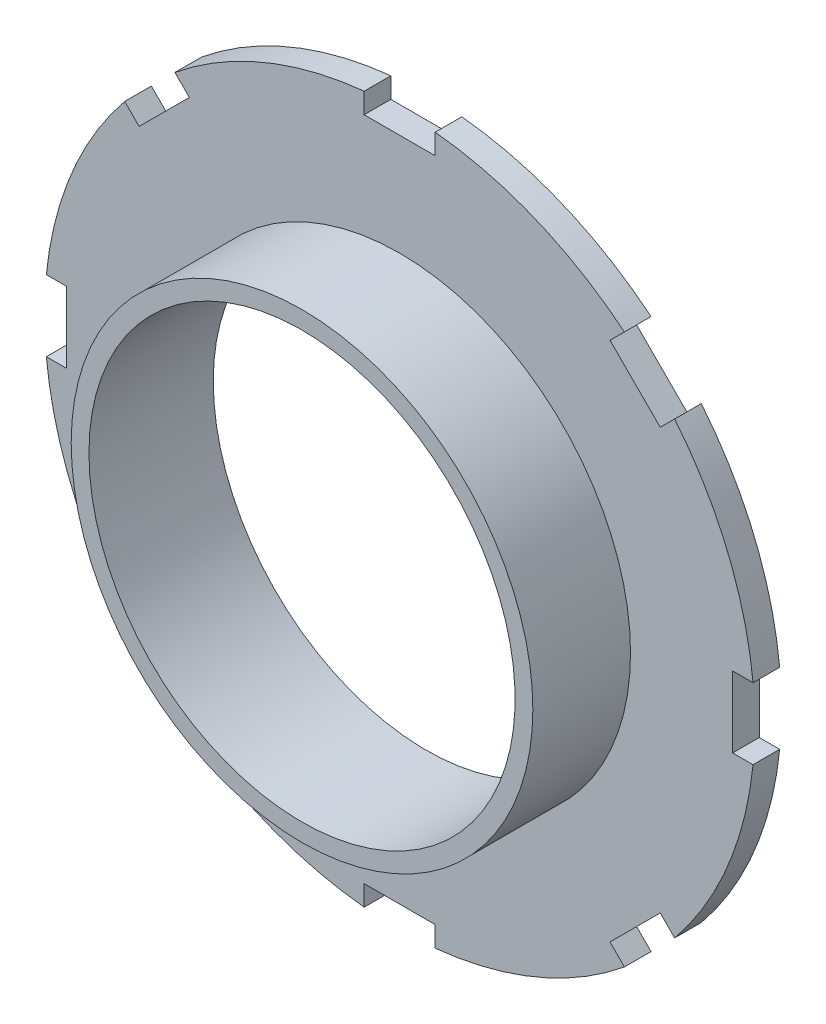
ISO-10303-21;
HEADER;
FILE_DESCRIPTION(('STEP AP214'),'2;1');
FILE_NAME('part.step','',(''),(''),'','','');
FILE_SCHEMA(('AUTOMOTIVE_DESIGN { 1 0 10303 214 1 1 1 1 }'));
ENDSEC;
DATA;
#1=APPLICATION_CONTEXT('core data for automotive mechanical design processes');
#2=APPLICATION_PROTOCOL_DEFINITION('international standard','automotive_design',2000,#1);
#3=PRODUCT_CONTEXT('',#1,'mechanical');
#4=PRODUCT('Part','Part','',(#3));
#5=PRODUCT_RELATED_PRODUCT_CATEGORY('part','',(#4));
#6=PRODUCT_DEFINITION_FORMATION('','',#4);
#7=PRODUCT_DEFINITION_CONTEXT('part definition',#1,'design');
#8=PRODUCT_DEFINITION('design','',#6,#7);
#9=PRODUCT_DEFINITION_SHAPE('','',#8);
#10=(LENGTH_UNIT() NAMED_UNIT(*) SI_UNIT(.MILLI.,.METRE.));
#11=(NAMED_UNIT(*) PLANE_ANGLE_UNIT() SI_UNIT($,.RADIAN.));
#12=(NAMED_UNIT(*) SI_UNIT($,.STERADIAN.) SOLID_ANGLE_UNIT());
#13=UNCERTAINTY_MEASURE_WITH_UNIT(LENGTH_MEASURE(1.E-05),#10,'distance_accuracy_value','');
#14=(GEOMETRIC_REPRESENTATION_CONTEXT(3) GLOBAL_UNCERTAINTY_ASSIGNED_CONTEXT((#13)) GLOBAL_UNIT_ASSIGNED_CONTEXT((#10,
#11,#12)) REPRESENTATION_CONTEXT('',''));
#15=CARTESIAN_POINT('',(0.,0.,0.));
#16=DIRECTION('',(0.,0.,1.));
#17=DIRECTION('',(1.,0.,0.));
#18=AXIS2_PLACEMENT_3D('',#15,#16,#17);
#19=CARTESIAN_POINT('',(0.,0.,3.));
#20=DIRECTION('',(0.,0.,1.));
#21=DIRECTION('',(1.,0.,0.));
#22=AXIS2_PLACEMENT_3D('',#19,#20,#21);
#23=PLANE('',#22);
#24=CARTESIAN_POINT('',(0.,0.,3.));
#25=DIRECTION('',(0.,0.,1.));
#26=DIRECTION('',(1.,0.,0.));
#27=AXIS2_PLACEMENT_3D('',#24,#25,#26);
#28=CIRCLE('',#27,26.);
#29=CARTESIAN_POINT('',(26.,0.,3.));
#30=VERTEX_POINT('',#29);
#31=EDGE_CURVE('E335',#30,#30,#28,.T.);
#32=ORIENTED_EDGE('',*,*,#31,.F.);
#33=EDGE_LOOP('',(#32));
#34=FACE_BOUND('',#33,.T.);
#35=CARTESIAN_POINT('',(0.,0.,3.));
#36=DIRECTION('',(0.,0.,1.));
#37=DIRECTION('',(1.,0.,0.));
#38=AXIS2_PLACEMENT_3D('',#35,#36,#37);
#39=CIRCLE('',#38,40.);
#40=CARTESIAN_POINT('',(-4.,39.7994974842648,3.));
#41=VERTEX_POINT('',#40);
#42=CARTESIAN_POINT('',(-25.314067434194,30.9709216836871,3.));
#43=VERTEX_POINT('',#42);
#44=EDGE_CURVE('E327',#41,#43,#39,.T.);
#45=ORIENTED_EDGE('',*,*,#44,.T.);
#46=DIRECTION('',(0.707106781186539,-0.707106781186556,0.));
#47=VECTOR('',#46,1.);
#48=CARTESIAN_POINT('',(2.82842712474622,2.82842712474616,3.));
#49=LINE('',#48,#47);
#50=CARTESIAN_POINT('',(-23.688077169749,29.344931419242,3.));
#51=VERTEX_POINT('',#50);
#52=EDGE_CURVE('E46',#43,#51,#49,.T.);
#53=ORIENTED_EDGE('',*,*,#52,.T.);
#54=DIRECTION('',(-0.707106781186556,-0.707106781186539,0.));
#55=VECTOR('',#54,1.);
#56=CARTESIAN_POINT('',(-26.5165042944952,26.5165042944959,3.));
#57=LINE('',#56,#55);
#58=CARTESIAN_POINT('',(-29.3449314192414,23.6880771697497,3.));
#59=VERTEX_POINT('',#58);
#60=EDGE_CURVE('E50',#51,#59,#57,.T.);
#61=ORIENTED_EDGE('',*,*,#60,.T.);
#62=DIRECTION('',(-0.707106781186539,0.707106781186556,0.));
#63=VECTOR('',#62,1.);
#64=CARTESIAN_POINT('',(-2.82842712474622,-2.82842712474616,3.));
#65=LINE('',#64,#63);
#66=CARTESIAN_POINT('',(-30.9709216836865,25.3140674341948,3.));
#67=VERTEX_POINT('',#66);
#68=EDGE_CURVE('E471',#59,#67,#65,.T.);
#69=ORIENTED_EDGE('',*,*,#68,.T.);
#70=CARTESIAN_POINT('',(-39.7994974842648,4.00000000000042,3.));
#71=VERTEX_POINT('',#70);
#72=EDGE_CURVE('E256',#67,#71,#39,.T.);
#73=ORIENTED_EDGE('',*,*,#72,.T.);
#74=DIRECTION('',(1.,0.,0.));
#75=VECTOR('',#74,1.);
#76=CARTESIAN_POINT('',(0.,4.,3.));
#77=LINE('',#76,#75);
#78=CARTESIAN_POINT('',(-37.5,4.00000000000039,3.));
#79=VERTEX_POINT('',#78);
#80=EDGE_CURVE('E450',#71,#79,#77,.T.);
#81=ORIENTED_EDGE('',*,*,#80,.T.);
#82=DIRECTION('',(0.,-1.,0.));
#83=VECTOR('',#82,1.);
#84=CARTESIAN_POINT('',(-37.5,3.92791878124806E-13,3.));
#85=LINE('',#84,#83);
#86=CARTESIAN_POINT('',(-37.5,-3.99999999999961,3.));
#87=VERTEX_POINT('',#86);
#88=EDGE_CURVE('E454',#79,#87,#85,.T.);
#89=ORIENTED_EDGE('',*,*,#88,.T.);
#90=DIRECTION('',(-1.,0.,0.));
#91=VECTOR('',#90,1.);
#92=CARTESIAN_POINT('',(0.,-4.,3.));
#93=LINE('',#92,#91);
#94=CARTESIAN_POINT('',(-39.7994974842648,-3.99999999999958,3.));
#95=VERTEX_POINT('',#94);
#96=EDGE_CURVE('E456',#87,#95,#93,.T.);
#97=ORIENTED_EDGE('',*,*,#96,.T.);
#98=CARTESIAN_POINT('',(-30.970921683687,-25.3140674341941,3.));
#99=VERTEX_POINT('',#98);
#100=EDGE_CURVE('E531',#95,#99,#39,.T.);
#101=ORIENTED_EDGE('',*,*,#100,.T.);
#102=DIRECTION('',(0.707106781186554,0.707106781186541,0.));
#103=VECTOR('',#102,1.);
#104=CARTESIAN_POINT('',(-2.82842712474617,2.82842712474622,3.));
#105=LINE('',#104,#103);
#106=CARTESIAN_POINT('',(-29.3449314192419,-23.6880771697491,3.));
#107=VERTEX_POINT('',#106);
#108=EDGE_CURVE('E432',#99,#107,#105,.T.);
#109=ORIENTED_EDGE('',*,*,#108,.T.);
#110=DIRECTION('',(0.707106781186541,-0.707106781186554,0.));
#111=VECTOR('',#110,1.);
#112=CARTESIAN_POINT('',(-26.5165042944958,-26.5165042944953,3.));
#113=LINE('',#112,#111);
#114=CARTESIAN_POINT('',(-23.6880771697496,-29.3449314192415,3.));
#115=VERTEX_POINT('',#114);
#116=EDGE_CURVE('E436',#107,#115,#113,.T.);
#117=ORIENTED_EDGE('',*,*,#116,.T.);
#118=DIRECTION('',(-0.707106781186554,-0.707106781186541,0.));
#119=VECTOR('',#118,1.);
#120=CARTESIAN_POINT('',(2.82842712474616,-2.82842712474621,3.));
#121=LINE('',#120,#119);
#122=CARTESIAN_POINT('',(-25.3140674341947,-30.9709216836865,3.));
#123=VERTEX_POINT('',#122);
#124=EDGE_CURVE('E438',#115,#123,#121,.T.);
#125=ORIENTED_EDGE('',*,*,#124,.T.);
#126=CARTESIAN_POINT('',(-4.00000000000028,-39.7994974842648,3.));
#127=VERTEX_POINT('',#126);
#128=EDGE_CURVE('E538',#123,#127,#39,.T.);
#129=ORIENTED_EDGE('',*,*,#128,.T.);
#130=DIRECTION('',(0.,1.,0.));
#131=VECTOR('',#130,1.);
#132=CARTESIAN_POINT('',(-4.,0.,3.));
#133=LINE('',#132,#131);
#134=CARTESIAN_POINT('',(-4.00000000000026,-37.5,3.));
#135=VERTEX_POINT('',#134);
#136=EDGE_CURVE('E414',#127,#135,#133,.T.);
#137=ORIENTED_EDGE('',*,*,#136,.T.);
#138=DIRECTION('',(1.,0.,0.));
#139=VECTOR('',#138,1.);
#140=CARTESIAN_POINT('',(-2.61861252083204E-13,-37.5,3.));
#141=LINE('',#140,#139);
#142=CARTESIAN_POINT('',(3.99999999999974,-37.5,3.));
#143=VERTEX_POINT('',#142);
#144=EDGE_CURVE('E418',#135,#143,#141,.T.);
#145=ORIENTED_EDGE('',*,*,#144,.T.);
#146=DIRECTION('',(0.,-1.,0.));
#147=VECTOR('',#146,1.);
#148=CARTESIAN_POINT('',(4.,0.,3.));
#149=LINE('',#148,#147);
#150=CARTESIAN_POINT('',(3.99999999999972,-39.7994974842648,3.));
#151=VERTEX_POINT('',#150);
#152=EDGE_CURVE('E420',#143,#151,#149,.T.);
#153=ORIENTED_EDGE('',*,*,#152,.T.);
#154=CARTESIAN_POINT('',(25.3140674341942,-30.9709216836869,3.));
#155=VERTEX_POINT('',#154);
#156=EDGE_CURVE('E542',#151,#155,#39,.T.);
#157=ORIENTED_EDGE('',*,*,#156,.T.);
#158=DIRECTION('',(-0.707106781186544,0.707106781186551,0.));
#159=VECTOR('',#158,1.);
#160=CARTESIAN_POINT('',(-2.8284271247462,-2.82842712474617,3.));
#161=LINE('',#160,#159);
#162=CARTESIAN_POINT('',(23.6880771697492,-29.3449314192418,3.));
#163=VERTEX_POINT('',#162);
#164=EDGE_CURVE('E396',#155,#163,#161,.T.);
#165=ORIENTED_EDGE('',*,*,#164,.T.);
#166=DIRECTION('',(0.707106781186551,0.707106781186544,0.));
#167=VECTOR('',#166,1.);
#168=CARTESIAN_POINT('',(26.5165042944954,-26.5165042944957,3.));
#169=LINE('',#168,#167);
#170=CARTESIAN_POINT('',(29.3449314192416,-23.6880771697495,3.));
#171=VERTEX_POINT('',#170);
#172=EDGE_CURVE('E400',#163,#171,#169,.T.);
#173=ORIENTED_EDGE('',*,*,#172,.T.);
#174=DIRECTION('',(0.707106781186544,-0.707106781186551,0.));
#175=VECTOR('',#174,1.);
#176=CARTESIAN_POINT('',(2.82842712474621,2.82842712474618,3.));
#177=LINE('',#176,#175);
#178=CARTESIAN_POINT('',(30.9709216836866,-25.3140674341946,3.));
#179=VERTEX_POINT('',#178);
#180=EDGE_CURVE('E402',#171,#179,#177,.T.);
#181=ORIENTED_EDGE('',*,*,#180,.T.);
#182=CARTESIAN_POINT('',(39.7994974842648,-4.00000000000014,3.));
#183=VERTEX_POINT('',#182);
#184=EDGE_CURVE('E543',#179,#183,#39,.T.);
#185=ORIENTED_EDGE('',*,*,#184,.T.);
#186=DIRECTION('',(-1.,0.,0.));
#187=VECTOR('',#186,1.);
#188=CARTESIAN_POINT('',(0.,-4.,3.));
#189=LINE('',#188,#187);
#190=CARTESIAN_POINT('',(37.5,-4.00000000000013,3.));
#191=VERTEX_POINT('',#190);
#192=EDGE_CURVE('E378',#183,#191,#189,.T.);
#193=ORIENTED_EDGE('',*,*,#192,.T.);
#194=DIRECTION('',(0.,1.,0.));
#195=VECTOR('',#194,1.);
#196=CARTESIAN_POINT('',(37.5,-1.30930626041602E-13,3.));
#197=LINE('',#196,#195);
#198=CARTESIAN_POINT('',(37.5,3.99999999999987,3.));
#199=VERTEX_POINT('',#198);
#200=EDGE_CURVE('E382',#191,#199,#197,.T.);
#201=ORIENTED_EDGE('',*,*,#200,.T.);
#202=DIRECTION('',(1.,0.,0.));
#203=VECTOR('',#202,1.);
#204=CARTESIAN_POINT('',(0.,4.,3.));
#205=LINE('',#204,#203);
#206=CARTESIAN_POINT('',(39.7994974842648,3.99999999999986,3.));
#207=VERTEX_POINT('',#206);
#208=EDGE_CURVE('E384',#199,#207,#205,.T.);
#209=ORIENTED_EDGE('',*,*,#208,.T.);
#210=CARTESIAN_POINT('',(30.9709216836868,25.3140674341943,3.));
#211=VERTEX_POINT('',#210);
#212=EDGE_CURVE('E545',#207,#211,#39,.T.);
#213=ORIENTED_EDGE('',*,*,#212,.T.);
#214=DIRECTION('',(-0.707106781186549,-0.707106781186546,0.));
#215=VECTOR('',#214,1.);
#216=CARTESIAN_POINT('',(2.82842712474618,-2.82842712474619,3.));
#217=LINE('',#216,#215);
#218=CARTESIAN_POINT('',(29.3449314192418,23.6880771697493,3.));
#219=VERTEX_POINT('',#218);
#220=EDGE_CURVE('E360',#211,#219,#217,.T.);
#221=ORIENTED_EDGE('',*,*,#220,.T.);
#222=DIRECTION('',(-0.707106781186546,0.707106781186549,0.));
#223=VECTOR('',#222,1.);
#224=CARTESIAN_POINT('',(26.5165042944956,26.5165042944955,3.));
#225=LINE('',#224,#223);
#226=CARTESIAN_POINT('',(23.6880771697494,29.3449314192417,3.));
#227=VERTEX_POINT('',#226);
#228=EDGE_CURVE('E364',#219,#227,#225,.T.);
#229=ORIENTED_EDGE('',*,*,#228,.T.);
#230=DIRECTION('',(0.707106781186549,0.707106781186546,0.));
#231=VECTOR('',#230,1.);
#232=CARTESIAN_POINT('',(-2.82842712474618,2.82842712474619,3.));
#233=LINE('',#232,#231);
#234=CARTESIAN_POINT('',(25.3140674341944,30.9709216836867,3.));
#235=VERTEX_POINT('',#234);
#236=EDGE_CURVE('E366',#227,#235,#233,.T.);
#237=ORIENTED_EDGE('',*,*,#236,.T.);
#238=CARTESIAN_POINT('',(4.,39.7994974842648,3.));
#239=VERTEX_POINT('',#238);
#240=EDGE_CURVE('E328',#235,#239,#39,.T.);
#241=ORIENTED_EDGE('',*,*,#240,.T.);
#242=DIRECTION('',(0.,-1.,0.));
#243=VECTOR('',#242,1.);
#244=CARTESIAN_POINT('',(4.,0.,3.));
#245=LINE('',#244,#243);
#246=CARTESIAN_POINT('',(4.,37.5,3.));
#247=VERTEX_POINT('',#246);
#248=EDGE_CURVE('E344',#239,#247,#245,.T.);
#249=ORIENTED_EDGE('',*,*,#248,.T.);
#250=DIRECTION('',(-1.,0.,0.));
#251=VECTOR('',#250,1.);
#252=CARTESIAN_POINT('',(0.,37.5,3.));
#253=LINE('',#252,#251);
#254=CARTESIAN_POINT('',(-4.,37.5,3.));
#255=VERTEX_POINT('',#254);
#256=EDGE_CURVE('E346',#247,#255,#253,.T.);
#257=ORIENTED_EDGE('',*,*,#256,.T.);
#258=DIRECTION('',(0.,1.,0.));
#259=VECTOR('',#258,1.);
#260=CARTESIAN_POINT('',(-4.,0.,3.));
#261=LINE('',#260,#259);
#262=EDGE_CURVE('E348',#255,#41,#261,.T.);
#263=ORIENTED_EDGE('',*,*,#262,.T.);
#264=EDGE_LOOP('',(#45,#53,#61,#69,#73,#81,#89,#97,#101,#109,#117,#125,#129,#137,#145,#153,#157,
#165,#173,#181,#185,#193,#201,#209,#213,#221,#229,#237,#241,#249,#257,#263));
#265=FACE_BOUND('',#264,.T.);
#266=ADVANCED_FACE('F31',(#34,#265),#23,.T.);
#267=CARTESIAN_POINT('',(0.,0.,3.));
#268=DIRECTION('',(0.,0.,-1.));
#269=DIRECTION('',(-1.,0.,0.));
#270=AXIS2_PLACEMENT_3D('',#267,#268,#269);
#271=CYLINDRICAL_SURFACE('',#270,40.);
#272=DIRECTION('',(0.,0.,1.));
#273=VECTOR('',#272,1.);
#274=CARTESIAN_POINT('',(-25.314067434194,30.9709216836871,-146.074232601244));
#275=LINE('',#274,#273);
#276=CARTESIAN_POINT('',(-25.314067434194,30.9709216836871,0.));
#277=VERTEX_POINT('',#276);
#278=EDGE_CURVE('E473',#277,#43,#275,.T.);
#279=ORIENTED_EDGE('',*,*,#278,.T.);
#280=ORIENTED_EDGE('',*,*,#44,.F.);
#281=DIRECTION('',(0.,0.,1.));
#282=VECTOR('',#281,1.);
#283=CARTESIAN_POINT('',(-4.,39.7994974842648,-146.25));
#284=LINE('',#283,#282);
#285=CARTESIAN_POINT('',(-4.,39.7994974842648,0.));
#286=VERTEX_POINT('',#285);
#287=EDGE_CURVE('E356',#286,#41,#284,.T.);
#288=ORIENTED_EDGE('',*,*,#287,.F.);
#289=CARTESIAN_POINT('',(0.,0.,0.));
#290=DIRECTION('',(0.,0.,1.));
#291=DIRECTION('',(1.,0.,0.));
#292=AXIS2_PLACEMENT_3D('',#289,#290,#291);
#293=CIRCLE('',#292,40.);
#294=EDGE_CURVE('E249',#286,#277,#293,.T.);
#295=ORIENTED_EDGE('',*,*,#294,.T.);
#296=EDGE_LOOP('',(#279,#280,#288,#295));
#297=FACE_BOUND('',#296,.T.);
#298=ADVANCED_FACE('F33',(#297),#271,.T.);
#299=DIRECTION('',(0.,0.,1.));
#300=VECTOR('',#299,1.);
#301=CARTESIAN_POINT('',(-30.9709216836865,25.3140674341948,-146.074232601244));
#302=LINE('',#301,#300);
#303=CARTESIAN_POINT('',(-30.9709216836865,25.3140674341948,0.));
#304=VERTEX_POINT('',#303);
#305=EDGE_CURVE('E254',#304,#67,#302,.T.);
#306=ORIENTED_EDGE('',*,*,#305,.F.);
#307=CARTESIAN_POINT('',(-39.7994974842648,4.00000000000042,0.));
#308=VERTEX_POINT('',#307);
#309=EDGE_CURVE('E238',#304,#308,#293,.T.);
#310=ORIENTED_EDGE('',*,*,#309,.T.);
#311=DIRECTION('',(0.,0.,1.));
#312=VECTOR('',#311,1.);
#313=CARTESIAN_POINT('',(-39.7994974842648,4.00000000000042,-146.074232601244));
#314=LINE('',#313,#312);
#315=EDGE_CURVE('E458',#308,#71,#314,.T.);
#316=ORIENTED_EDGE('',*,*,#315,.T.);
#317=ORIENTED_EDGE('',*,*,#72,.F.);
#318=EDGE_LOOP('',(#306,#310,#316,#317));
#319=FACE_BOUND('',#318,.T.);
#320=ADVANCED_FACE('F255',(#319),#271,.T.);
#321=CARTESIAN_POINT('',(0.,0.,0.));
#322=DIRECTION('',(0.,0.,1.));
#323=DIRECTION('',(1.,0.,0.));
#324=AXIS2_PLACEMENT_3D('',#321,#322,#323);
#325=PLANE('',#324);
#326=CARTESIAN_POINT('',(0.,0.,0.));
#327=DIRECTION('',(0.,0.,-1.));
#328=DIRECTION('',(-1.,0.,0.));
#329=AXIS2_PLACEMENT_3D('',#326,#327,#328);
#330=CIRCLE('',#329,24.);
#331=CARTESIAN_POINT('',(-24.,0.,0.));
#332=VERTEX_POINT('',#331);
#333=EDGE_CURVE('E341',#332,#332,#330,.T.);
#334=ORIENTED_EDGE('',*,*,#333,.F.);
#335=EDGE_LOOP('',(#334));
#336=FACE_BOUND('',#335,.T.);
#337=DIRECTION('',(0.707106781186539,-0.707106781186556,0.));
#338=VECTOR('',#337,1.);
#339=CARTESIAN_POINT('',(2.82842712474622,2.82842712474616,0.));
#340=LINE('',#339,#338);
#341=CARTESIAN_POINT('',(-23.688077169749,29.344931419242,0.));
#342=VERTEX_POINT('',#341);
#343=EDGE_CURVE('E11',#277,#342,#340,.T.);
#344=ORIENTED_EDGE('',*,*,#343,.F.);
#345=ORIENTED_EDGE('',*,*,#294,.F.);
#346=DIRECTION('',(0.,1.,0.));
#347=VECTOR('',#346,1.);
#348=CARTESIAN_POINT('',(-4.,0.,0.));
#349=LINE('',#348,#347);
#350=CARTESIAN_POINT('',(-4.,37.5,0.));
#351=VERTEX_POINT('',#350);
#352=EDGE_CURVE('E324',#351,#286,#349,.T.);
#353=ORIENTED_EDGE('',*,*,#352,.F.);
#354=DIRECTION('',(-1.,0.,0.));
#355=VECTOR('',#354,1.);
#356=CARTESIAN_POINT('',(0.,37.5,0.));
#357=LINE('',#356,#355);
#358=CARTESIAN_POINT('',(4.,37.5,0.));
#359=VERTEX_POINT('',#358);
#360=EDGE_CURVE('E321',#359,#351,#357,.T.);
#361=ORIENTED_EDGE('',*,*,#360,.F.);
#362=DIRECTION('',(0.,-1.,0.));
#363=VECTOR('',#362,1.);
#364=CARTESIAN_POINT('',(4.,0.,0.));
#365=LINE('',#364,#363);
#366=CARTESIAN_POINT('',(4.,39.7994974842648,0.));
#367=VERTEX_POINT('',#366);
#368=EDGE_CURVE('E318',#367,#359,#365,.T.);
#369=ORIENTED_EDGE('',*,*,#368,.F.);
#370=CARTESIAN_POINT('',(25.3140674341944,30.9709216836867,0.));
#371=VERTEX_POINT('',#370);
#372=EDGE_CURVE('E331',#371,#367,#293,.T.);
#373=ORIENTED_EDGE('',*,*,#372,.F.);
#374=DIRECTION('',(0.707106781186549,0.707106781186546,0.));
#375=VECTOR('',#374,1.);
#376=CARTESIAN_POINT('',(-2.82842712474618,2.82842712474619,0.));
#377=LINE('',#376,#375);
#378=CARTESIAN_POINT('',(23.6880771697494,29.3449314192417,0.));
#379=VERTEX_POINT('',#378);
#380=EDGE_CURVE('E315',#379,#371,#377,.T.);
#381=ORIENTED_EDGE('',*,*,#380,.F.);
#382=DIRECTION('',(-0.707106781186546,0.707106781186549,0.));
#383=VECTOR('',#382,1.);
#384=CARTESIAN_POINT('',(26.5165042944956,26.5165042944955,0.));
#385=LINE('',#384,#383);
#386=CARTESIAN_POINT('',(29.3449314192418,23.6880771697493,0.));
#387=VERTEX_POINT('',#386);
#388=EDGE_CURVE('E312',#387,#379,#385,.T.);
#389=ORIENTED_EDGE('',*,*,#388,.F.);
#390=DIRECTION('',(-0.707106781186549,-0.707106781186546,0.));
#391=VECTOR('',#390,1.);
#392=CARTESIAN_POINT('',(2.82842712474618,-2.82842712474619,0.));
#393=LINE('',#392,#391);
#394=CARTESIAN_POINT('',(30.9709216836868,25.3140674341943,0.));
#395=VERTEX_POINT('',#394);
#396=EDGE_CURVE('E309',#395,#387,#393,.T.);
#397=ORIENTED_EDGE('',*,*,#396,.F.);
#398=CARTESIAN_POINT('',(39.7994974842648,3.99999999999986,0.));
#399=VERTEX_POINT('',#398);
#400=EDGE_CURVE('E503',#399,#395,#293,.T.);
#401=ORIENTED_EDGE('',*,*,#400,.F.);
#402=DIRECTION('',(1.,0.,0.));
#403=VECTOR('',#402,1.);
#404=CARTESIAN_POINT('',(0.,4.,0.));
#405=LINE('',#404,#403);
#406=CARTESIAN_POINT('',(37.5,3.99999999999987,0.));
#407=VERTEX_POINT('',#406);
#408=EDGE_CURVE('E306',#407,#399,#405,.T.);
#409=ORIENTED_EDGE('',*,*,#408,.F.);
#410=DIRECTION('',(0.,1.,0.));
#411=VECTOR('',#410,1.);
#412=CARTESIAN_POINT('',(37.5,-1.30930626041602E-13,0.));
#413=LINE('',#412,#411);
#414=CARTESIAN_POINT('',(37.5,-4.00000000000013,0.));
#415=VERTEX_POINT('',#414);
#416=EDGE_CURVE('E303',#415,#407,#413,.T.);
#417=ORIENTED_EDGE('',*,*,#416,.F.);
#418=DIRECTION('',(-1.,0.,0.));
#419=VECTOR('',#418,1.);
#420=CARTESIAN_POINT('',(0.,-4.,0.));
#421=LINE('',#420,#419);
#422=CARTESIAN_POINT('',(39.7994974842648,-4.00000000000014,0.));
#423=VERTEX_POINT('',#422);
#424=EDGE_CURVE('E300',#423,#415,#421,.T.);
#425=ORIENTED_EDGE('',*,*,#424,.F.);
#426=CARTESIAN_POINT('',(30.9709216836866,-25.3140674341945,0.));
#427=VERTEX_POINT('',#426);
#428=EDGE_CURVE('E504',#427,#423,#293,.T.);
#429=ORIENTED_EDGE('',*,*,#428,.F.);
#430=DIRECTION('',(0.707106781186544,-0.707106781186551,0.));
#431=VECTOR('',#430,1.);
#432=CARTESIAN_POINT('',(2.82842712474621,2.82842712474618,0.));
#433=LINE('',#432,#431);
#434=CARTESIAN_POINT('',(29.3449314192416,-23.6880771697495,0.));
#435=VERTEX_POINT('',#434);
#436=EDGE_CURVE('E297',#435,#427,#433,.T.);
#437=ORIENTED_EDGE('',*,*,#436,.F.);
#438=DIRECTION('',(0.707106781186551,0.707106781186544,0.));
#439=VECTOR('',#438,1.);
#440=CARTESIAN_POINT('',(26.5165042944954,-26.5165042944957,0.));
#441=LINE('',#440,#439);
#442=CARTESIAN_POINT('',(23.6880771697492,-29.3449314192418,0.));
#443=VERTEX_POINT('',#442);
#444=EDGE_CURVE('E294',#443,#435,#441,.T.);
#445=ORIENTED_EDGE('',*,*,#444,.F.);
#446=DIRECTION('',(-0.707106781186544,0.707106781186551,0.));
#447=VECTOR('',#446,1.);
#448=CARTESIAN_POINT('',(-2.8284271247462,-2.82842712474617,0.));
#449=LINE('',#448,#447);
#450=CARTESIAN_POINT('',(25.3140674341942,-30.9709216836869,0.));
#451=VERTEX_POINT('',#450);
#452=EDGE_CURVE('E291',#451,#443,#449,.T.);
#453=ORIENTED_EDGE('',*,*,#452,.F.);
#454=CARTESIAN_POINT('',(3.99999999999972,-39.7994974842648,0.));
#455=VERTEX_POINT('',#454);
#456=EDGE_CURVE('E508',#455,#451,#293,.T.);
#457=ORIENTED_EDGE('',*,*,#456,.F.);
#458=DIRECTION('',(0.,-1.,0.));
#459=VECTOR('',#458,1.);
#460=CARTESIAN_POINT('',(4.,0.,0.));
#461=LINE('',#460,#459);
#462=CARTESIAN_POINT('',(3.99999999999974,-37.5,0.));
#463=VERTEX_POINT('',#462);
#464=EDGE_CURVE('E288',#463,#455,#461,.T.);
#465=ORIENTED_EDGE('',*,*,#464,.F.);
#466=DIRECTION('',(1.,0.,0.));
#467=VECTOR('',#466,1.);
#468=CARTESIAN_POINT('',(-2.61861252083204E-13,-37.5,0.));
#469=LINE('',#468,#467);
#470=CARTESIAN_POINT('',(-4.00000000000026,-37.5,0.));
#471=VERTEX_POINT('',#470);
#472=EDGE_CURVE('E285',#471,#463,#469,.T.);
#473=ORIENTED_EDGE('',*,*,#472,.F.);
#474=DIRECTION('',(0.,1.,0.));
#475=VECTOR('',#474,1.);
#476=CARTESIAN_POINT('',(-4.,0.,0.));
#477=LINE('',#476,#475);
#478=CARTESIAN_POINT('',(-4.00000000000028,-39.7994974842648,0.));
#479=VERTEX_POINT('',#478);
#480=EDGE_CURVE('E282',#479,#471,#477,.T.);
#481=ORIENTED_EDGE('',*,*,#480,.F.);
#482=CARTESIAN_POINT('',(-25.3140674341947,-30.9709216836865,0.));
#483=VERTEX_POINT('',#482);
#484=EDGE_CURVE('E512',#483,#479,#293,.T.);
#485=ORIENTED_EDGE('',*,*,#484,.F.);
#486=DIRECTION('',(-0.707106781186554,-0.707106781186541,0.));
#487=VECTOR('',#486,1.);
#488=CARTESIAN_POINT('',(2.82842712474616,-2.82842712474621,0.));
#489=LINE('',#488,#487);
#490=CARTESIAN_POINT('',(-23.6880771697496,-29.3449314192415,0.));
#491=VERTEX_POINT('',#490);
#492=EDGE_CURVE('E279',#491,#483,#489,.T.);
#493=ORIENTED_EDGE('',*,*,#492,.F.);
#494=DIRECTION('',(0.707106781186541,-0.707106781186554,0.));
#495=VECTOR('',#494,1.);
#496=CARTESIAN_POINT('',(-26.5165042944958,-26.5165042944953,0.));
#497=LINE('',#496,#495);
#498=CARTESIAN_POINT('',(-29.3449314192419,-23.6880771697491,0.));
#499=VERTEX_POINT('',#498);
#500=EDGE_CURVE('E276',#499,#491,#497,.T.);
#501=ORIENTED_EDGE('',*,*,#500,.F.);
#502=DIRECTION('',(0.707106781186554,0.707106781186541,0.));
#503=VECTOR('',#502,1.);
#504=CARTESIAN_POINT('',(-2.82842712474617,2.82842712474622,0.));
#505=LINE('',#504,#503);
#506=CARTESIAN_POINT('',(-30.970921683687,-25.3140674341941,0.));
#507=VERTEX_POINT('',#506);
#508=EDGE_CURVE('E273',#507,#499,#505,.T.);
#509=ORIENTED_EDGE('',*,*,#508,.F.);
#510=CARTESIAN_POINT('',(-39.7994974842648,-3.99999999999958,0.));
#511=VERTEX_POINT('',#510);
#512=EDGE_CURVE('E250',#511,#507,#293,.T.);
#513=ORIENTED_EDGE('',*,*,#512,.F.);
#514=DIRECTION('',(-1.,0.,0.));
#515=VECTOR('',#514,1.);
#516=CARTESIAN_POINT('',(0.,-4.,0.));
#517=LINE('',#516,#515);
#518=CARTESIAN_POINT('',(-37.5,-3.99999999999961,0.));
#519=VERTEX_POINT('',#518);
#520=EDGE_CURVE('E270',#519,#511,#517,.T.);
#521=ORIENTED_EDGE('',*,*,#520,.F.);
#522=DIRECTION('',(0.,-1.,0.));
#523=VECTOR('',#522,1.);
#524=CARTESIAN_POINT('',(-37.5,3.92791878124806E-13,0.));
#525=LINE('',#524,#523);
#526=CARTESIAN_POINT('',(-37.5,4.00000000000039,0.));
#527=VERTEX_POINT('',#526);
#528=EDGE_CURVE('E265',#527,#519,#525,.T.);
#529=ORIENTED_EDGE('',*,*,#528,.F.);
#530=DIRECTION('',(1.,0.,0.));
#531=VECTOR('',#530,1.);
#532=CARTESIAN_POINT('',(0.,4.,0.));
#533=LINE('',#532,#531);
#534=EDGE_CURVE('E245',#308,#527,#533,.T.);
#535=ORIENTED_EDGE('',*,*,#534,.F.);
#536=ORIENTED_EDGE('',*,*,#309,.F.);
#537=DIRECTION('',(-0.707106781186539,0.707106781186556,0.));
#538=VECTOR('',#537,1.);
#539=CARTESIAN_POINT('',(-2.82842712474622,-2.82842712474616,0.));
#540=LINE('',#539,#538);
#541=CARTESIAN_POINT('',(-29.3449314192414,23.6880771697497,0.));
#542=VERTEX_POINT('',#541);
#543=EDGE_CURVE('E242',#542,#304,#540,.T.);
#544=ORIENTED_EDGE('',*,*,#543,.F.);
#545=DIRECTION('',(-0.707106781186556,-0.707106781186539,0.));
#546=VECTOR('',#545,1.);
#547=CARTESIAN_POINT('',(-26.5165042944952,26.5165042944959,0.));
#548=LINE('',#547,#546);
#549=EDGE_CURVE('E39',#342,#542,#548,.T.);
#550=ORIENTED_EDGE('',*,*,#549,.F.);
#551=EDGE_LOOP('',(#344,#345,#353,#361,#369,#373,#381,#389,#397,#401,#409,#417,#425,#429,#437,
#445,#453,#457,#465,#473,#481,#485,#493,#501,#509,#513,#521,#529,#535,#536,#544,#550));
#552=FACE_BOUND('',#551,.T.);
#553=ADVANCED_FACE('F240',(#336,#552),#325,.F.);
#554=DIRECTION('',(0.,0.,1.));
#555=VECTOR('',#554,1.);
#556=CARTESIAN_POINT('',(-39.7994974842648,-3.99999999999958,-146.074232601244));
#557=LINE('',#556,#555);
#558=EDGE_CURVE('E463',#511,#95,#557,.T.);
#559=ORIENTED_EDGE('',*,*,#558,.F.);
#560=ORIENTED_EDGE('',*,*,#512,.T.);
#561=DIRECTION('',(0.,0.,1.));
#562=VECTOR('',#561,1.);
#563=CARTESIAN_POINT('',(-30.970921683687,-25.3140674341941,-146.074232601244));
#564=LINE('',#563,#562);
#565=EDGE_CURVE('E440',#507,#99,#564,.T.);
#566=ORIENTED_EDGE('',*,*,#565,.T.);
#567=ORIENTED_EDGE('',*,*,#100,.F.);
#568=EDGE_LOOP('',(#559,#560,#566,#567));
#569=FACE_BOUND('',#568,.T.);
#570=ADVANCED_FACE('F522',(#569),#271,.T.);
#571=DIRECTION('',(0.,0.,1.));
#572=VECTOR('',#571,1.);
#573=CARTESIAN_POINT('',(-25.3140674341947,-30.9709216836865,-146.074232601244));
#574=LINE('',#573,#572);
#575=EDGE_CURVE('E446',#483,#123,#574,.T.);
#576=ORIENTED_EDGE('',*,*,#575,.F.);
#577=ORIENTED_EDGE('',*,*,#484,.T.);
#578=DIRECTION('',(0.,0.,1.));
#579=VECTOR('',#578,1.);
#580=CARTESIAN_POINT('',(-4.00000000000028,-39.7994974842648,-146.074232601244));
#581=LINE('',#580,#579);
#582=EDGE_CURVE('E422',#479,#127,#581,.T.);
#583=ORIENTED_EDGE('',*,*,#582,.T.);
#584=ORIENTED_EDGE('',*,*,#128,.F.);
#585=EDGE_LOOP('',(#576,#577,#583,#584));
#586=FACE_BOUND('',#585,.T.);
#587=ADVANCED_FACE('F539',(#586),#271,.T.);
#588=DIRECTION('',(0.,0.,1.));
#589=VECTOR('',#588,1.);
#590=CARTESIAN_POINT('',(3.99999999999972,-39.7994974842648,-146.074232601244));
#591=LINE('',#590,#589);
#592=EDGE_CURVE('E428',#455,#151,#591,.T.);
#593=ORIENTED_EDGE('',*,*,#592,.F.);
#594=ORIENTED_EDGE('',*,*,#456,.T.);
#595=DIRECTION('',(0.,0.,1.));
#596=VECTOR('',#595,1.);
#597=CARTESIAN_POINT('',(25.3140674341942,-30.9709216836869,-146.074232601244));
#598=LINE('',#597,#596);
#599=EDGE_CURVE('E404',#451,#155,#598,.T.);
#600=ORIENTED_EDGE('',*,*,#599,.T.);
#601=ORIENTED_EDGE('',*,*,#156,.F.);
#602=EDGE_LOOP('',(#593,#594,#600,#601));
#603=FACE_BOUND('',#602,.T.);
#604=ADVANCED_FACE('F586',(#603),#271,.T.);
#605=DIRECTION('',(0.,0.,1.));
#606=VECTOR('',#605,1.);
#607=CARTESIAN_POINT('',(30.9709216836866,-25.3140674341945,-146.074232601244));
#608=LINE('',#607,#606);
#609=EDGE_CURVE('E410',#427,#179,#608,.T.);
#610=ORIENTED_EDGE('',*,*,#609,.F.);
#611=ORIENTED_EDGE('',*,*,#428,.T.);
#612=DIRECTION('',(0.,0.,1.));
#613=VECTOR('',#612,1.);
#614=CARTESIAN_POINT('',(39.7994974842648,-4.00000000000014,-146.074232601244));
#615=LINE('',#614,#613);
#616=EDGE_CURVE('E386',#423,#183,#615,.T.);
#617=ORIENTED_EDGE('',*,*,#616,.T.);
#618=ORIENTED_EDGE('',*,*,#184,.F.);
#619=EDGE_LOOP('',(#610,#611,#617,#618));
#620=FACE_BOUND('',#619,.T.);
#621=ADVANCED_FACE('F573',(#620),#271,.T.);
#622=DIRECTION('',(0.,0.,1.));
#623=VECTOR('',#622,1.);
#624=CARTESIAN_POINT('',(39.7994974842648,3.99999999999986,-146.074232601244));
#625=LINE('',#624,#623);
#626=EDGE_CURVE('E392',#399,#207,#625,.T.);
#627=ORIENTED_EDGE('',*,*,#626,.F.);
#628=ORIENTED_EDGE('',*,*,#400,.T.);
#629=DIRECTION('',(0.,0.,1.));
#630=VECTOR('',#629,1.);
#631=CARTESIAN_POINT('',(30.9709216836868,25.3140674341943,-146.074232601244));
#632=LINE('',#631,#630);
#633=EDGE_CURVE('E368',#395,#211,#632,.T.);
#634=ORIENTED_EDGE('',*,*,#633,.T.);
#635=ORIENTED_EDGE('',*,*,#212,.F.);
#636=EDGE_LOOP('',(#627,#628,#634,#635));
#637=FACE_BOUND('',#636,.T.);
#638=ADVANCED_FACE('F560',(#637),#271,.T.);
#639=DIRECTION('',(0.,0.,1.));
#640=VECTOR('',#639,1.);
#641=CARTESIAN_POINT('',(25.3140674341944,30.9709216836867,-146.074232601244));
#642=LINE('',#641,#640);
#643=EDGE_CURVE('E374',#371,#235,#642,.T.);
#644=ORIENTED_EDGE('',*,*,#643,.F.);
#645=ORIENTED_EDGE('',*,*,#372,.T.);
#646=DIRECTION('',(0.,0.,1.));
#647=VECTOR('',#646,1.);
#648=CARTESIAN_POINT('',(4.,39.7994974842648,-146.25));
#649=LINE('',#648,#647);
#650=EDGE_CURVE('E350',#367,#239,#649,.T.);
#651=ORIENTED_EDGE('',*,*,#650,.T.);
#652=ORIENTED_EDGE('',*,*,#240,.F.);
#653=EDGE_LOOP('',(#644,#645,#651,#652));
#654=FACE_BOUND('',#653,.T.);
#655=ADVANCED_FACE('F502',(#654),#271,.T.);
#656=CARTESIAN_POINT('',(0.,0.,14.));
#657=DIRECTION('',(0.,0.,-1.));
#658=DIRECTION('',(-1.,0.,0.));
#659=AXIS2_PLACEMENT_3D('',#656,#657,#658);
#660=CYLINDRICAL_SURFACE('',#659,26.);
#661=CARTESIAN_POINT('',(0.,0.,14.));
#662=DIRECTION('',(0.,0.,1.));
#663=DIRECTION('',(1.,0.,0.));
#664=AXIS2_PLACEMENT_3D('',#661,#662,#663);
#665=CIRCLE('',#664,26.);
#666=CARTESIAN_POINT('',(26.,0.,14.));
#667=VERTEX_POINT('',#666);
#668=EDGE_CURVE('E332',#667,#667,#665,.T.);
#669=ORIENTED_EDGE('',*,*,#668,.F.);
#670=EDGE_LOOP('',(#669));
#671=FACE_BOUND('',#670,.T.);
#672=ORIENTED_EDGE('',*,*,#31,.T.);
#673=EDGE_LOOP('',(#672));
#674=FACE_BOUND('',#673,.T.);
#675=ADVANCED_FACE('F616',(#671,#674),#660,.T.);
#676=CARTESIAN_POINT('',(0.,0.,14.));
#677=DIRECTION('',(0.,0.,1.));
#678=DIRECTION('',(1.,0.,0.));
#679=AXIS2_PLACEMENT_3D('',#676,#677,#678);
#680=PLANE('',#679);
#681=CARTESIAN_POINT('',(0.,0.,14.));
#682=DIRECTION('',(0.,0.,-1.));
#683=DIRECTION('',(-1.,0.,0.));
#684=AXIS2_PLACEMENT_3D('',#681,#682,#683);
#685=CIRCLE('',#684,24.);
#686=CARTESIAN_POINT('',(-24.,0.,14.));
#687=VERTEX_POINT('',#686);
#688=EDGE_CURVE('E338',#687,#687,#685,.T.);
#689=ORIENTED_EDGE('',*,*,#688,.T.);
#690=EDGE_LOOP('',(#689));
#691=FACE_BOUND('',#690,.T.);
#692=ORIENTED_EDGE('',*,*,#668,.T.);
#693=EDGE_LOOP('',(#692));
#694=FACE_BOUND('',#693,.T.);
#695=ADVANCED_FACE('F619',(#691,#694),#680,.T.);
#696=CARTESIAN_POINT('',(0.,0.,14.));
#697=DIRECTION('',(0.,0.,-1.));
#698=DIRECTION('',(-1.,0.,0.));
#699=AXIS2_PLACEMENT_3D('',#696,#697,#698);
#700=CYLINDRICAL_SURFACE('',#699,24.);
#701=CARTESIAN_POINT('',(-24.,0.,14.));
#702=CARTESIAN_POINT('',(-24.,0.,13.8541666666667));
#703=CARTESIAN_POINT('',(-24.,0.,13.7083333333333));
#704=CARTESIAN_POINT('',(-24.,0.,13.4166666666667));
#705=CARTESIAN_POINT('',(-24.,0.,13.2708333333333));
#706=CARTESIAN_POINT('',(-24.,0.,12.9791666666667));
#707=CARTESIAN_POINT('',(-24.,0.,12.8333333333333));
#708=CARTESIAN_POINT('',(-24.,0.,12.5416666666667));
#709=CARTESIAN_POINT('',(-24.,0.,12.3958333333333));
#710=CARTESIAN_POINT('',(-24.,0.,12.1041666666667));
#711=CARTESIAN_POINT('',(-24.,0.,11.9583333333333));
#712=CARTESIAN_POINT('',(-24.,0.,11.6666666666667));
#713=CARTESIAN_POINT('',(-24.,0.,11.5208333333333));
#714=CARTESIAN_POINT('',(-24.,0.,11.2291666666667));
#715=CARTESIAN_POINT('',(-24.,0.,11.0833333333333));
#716=CARTESIAN_POINT('',(-24.,0.,10.7916666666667));
#717=CARTESIAN_POINT('',(-24.,0.,10.6458333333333));
#718=CARTESIAN_POINT('',(-24.,0.,10.3541666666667));
#719=CARTESIAN_POINT('',(-24.,0.,10.2083333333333));
#720=CARTESIAN_POINT('',(-24.,0.,9.91666666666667));
#721=CARTESIAN_POINT('',(-24.,0.,9.77083333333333));
#722=CARTESIAN_POINT('',(-24.,0.,9.47916666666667));
#723=CARTESIAN_POINT('',(-24.,0.,9.33333333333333));
#724=CARTESIAN_POINT('',(-24.,0.,9.04166666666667));
#725=CARTESIAN_POINT('',(-24.,0.,8.89583333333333));
#726=CARTESIAN_POINT('',(-24.,0.,8.60416666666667));
#727=CARTESIAN_POINT('',(-24.,0.,8.45833333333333));
#728=CARTESIAN_POINT('',(-24.,0.,8.16666666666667));
#729=CARTESIAN_POINT('',(-24.,0.,8.02083333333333));
#730=CARTESIAN_POINT('',(-24.,0.,7.72916666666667));
#731=CARTESIAN_POINT('',(-24.,0.,7.58333333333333));
#732=CARTESIAN_POINT('',(-24.,0.,7.29166666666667));
#733=CARTESIAN_POINT('',(-24.,0.,7.14583333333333));
#734=CARTESIAN_POINT('',(-24.,0.,6.85416666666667));
#735=CARTESIAN_POINT('',(-24.,0.,6.70833333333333));
#736=CARTESIAN_POINT('',(-24.,0.,6.41666666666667));
#737=CARTESIAN_POINT('',(-24.,0.,6.27083333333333));
#738=CARTESIAN_POINT('',(-24.,0.,5.97916666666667));
#739=CARTESIAN_POINT('',(-24.,0.,5.83333333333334));
#740=CARTESIAN_POINT('',(-24.,0.,5.54166666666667));
#741=CARTESIAN_POINT('',(-24.,0.,5.39583333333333));
#742=CARTESIAN_POINT('',(-24.,0.,5.10416666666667));
#743=CARTESIAN_POINT('',(-24.,0.,4.95833333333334));
#744=CARTESIAN_POINT('',(-24.,0.,4.66666666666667));
#745=CARTESIAN_POINT('',(-24.,0.,4.52083333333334));
#746=CARTESIAN_POINT('',(-24.,0.,4.22916666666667));
#747=CARTESIAN_POINT('',(-24.,0.,4.08333333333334));
#748=CARTESIAN_POINT('',(-24.,0.,3.79166666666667));
#749=CARTESIAN_POINT('',(-24.,0.,3.64583333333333));
#750=CARTESIAN_POINT('',(-24.,0.,3.35416666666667));
#751=CARTESIAN_POINT('',(-24.,0.,3.20833333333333));
#752=CARTESIAN_POINT('',(-24.,0.,2.91666666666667));
#753=CARTESIAN_POINT('',(-24.,0.,2.77083333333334));
#754=CARTESIAN_POINT('',(-24.,0.,2.47916666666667));
#755=CARTESIAN_POINT('',(-24.,0.,2.33333333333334));
#756=CARTESIAN_POINT('',(-24.,0.,2.04166666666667));
#757=CARTESIAN_POINT('',(-24.,0.,1.89583333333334));
#758=CARTESIAN_POINT('',(-24.,0.,1.60416666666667));
#759=CARTESIAN_POINT('',(-24.,0.,1.45833333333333));
#760=CARTESIAN_POINT('',(-24.,0.,1.16666666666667));
#761=CARTESIAN_POINT('',(-24.,0.,1.02083333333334));
#762=CARTESIAN_POINT('',(-24.,0.,0.729166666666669));
#763=CARTESIAN_POINT('',(-24.,0.,0.583333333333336));
#764=CARTESIAN_POINT('',(-24.,0.,0.291666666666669));
#765=CARTESIAN_POINT('',(-24.,0.,0.145833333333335));
#766=CARTESIAN_POINT('',(-24.,0.,0.));
#767=B_SPLINE_CURVE_WITH_KNOTS('',3,(#701,#702,#703,#704,#705,#706,#707,#708,#709,#710,#711,
#712,#713,#714,#715,#716,#717,#718,#719,#720,#721,#722,#723,#724,#725,#726,#727,#728,#729,#730,
#731,#732,#733,#734,#735,#736,#737,#738,#739,#740,#741,#742,#743,#744,#745,#746,#747,#748,#749,
#750,#751,#752,#753,#754,#755,#756,#757,#758,#759,#760,#761,#762,#763,#764,#765,#766),
.UNSPECIFIED.,.F.,.F.,(4,2,2,2,2,2,2,2,2,2,2,2,2,2,2,2,2,2,2,2,2,2,2,2,2,2,2,2,2,2,2,2,4),(0.,
0.4375,0.875000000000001,1.3125,1.75,2.1875,2.625,3.0625,3.5,3.9375,4.375,4.8125,5.25,5.6875,
6.125,6.5625,7.,7.4375,7.875,8.3125,8.75,9.1875,9.625,10.0625,10.5,10.9375,11.375,11.8125,12.25,
12.6875,13.125,13.5625,14.),.UNSPECIFIED.);
#768=EDGE_CURVE('BSEAM623',#687,#332,#767,.T.);
#769=ORIENTED_EDGE('',*,*,#688,.F.);
#770=ORIENTED_EDGE('',*,*,#333,.T.);
#771=ORIENTED_EDGE('',*,*,#768,.T.);
#772=ORIENTED_EDGE('',*,*,#768,.F.);
#773=EDGE_LOOP('',(#769,#771,#770,#772));
#774=FACE_BOUND('',#773,.T.);
#775=ADVANCED_FACE('F623',(#774),#700,.F.);
#776=CARTESIAN_POINT('',(4.,39.7994974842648,-146.25));
#777=DIRECTION('',(-1.,0.,0.));
#778=DIRECTION('',(0.,0.,1.));
#779=AXIS2_PLACEMENT_3D('',#776,#777,#778);
#780=PLANE('',#779);
#781=ORIENTED_EDGE('',*,*,#248,.F.);
#782=ORIENTED_EDGE('',*,*,#650,.F.);
#783=ORIENTED_EDGE('',*,*,#368,.T.);
#784=DIRECTION('',(0.,0.,1.));
#785=VECTOR('',#784,1.);
#786=CARTESIAN_POINT('',(4.,37.5,-146.25));
#787=LINE('',#786,#785);
#788=EDGE_CURVE('E353',#359,#247,#787,.T.);
#789=ORIENTED_EDGE('',*,*,#788,.T.);
#790=EDGE_LOOP('',(#781,#782,#783,#789));
#791=FACE_BOUND('',#790,.T.);
#792=ADVANCED_FACE('F498',(#791),#780,.T.);
#793=CARTESIAN_POINT('',(4.,37.5,-146.25));
#794=DIRECTION('',(0.,1.,0.));
#795=DIRECTION('',(0.,0.,1.));
#796=AXIS2_PLACEMENT_3D('',#793,#794,#795);
#797=PLANE('',#796);
#798=ORIENTED_EDGE('',*,*,#256,.F.);
#799=ORIENTED_EDGE('',*,*,#788,.F.);
#800=ORIENTED_EDGE('',*,*,#360,.T.);
#801=DIRECTION('',(0.,0.,1.));
#802=VECTOR('',#801,1.);
#803=CARTESIAN_POINT('',(-4.,37.5,-146.25));
#804=LINE('',#803,#802);
#805=EDGE_CURVE('E357',#351,#255,#804,.T.);
#806=ORIENTED_EDGE('',*,*,#805,.T.);
#807=EDGE_LOOP('',(#798,#799,#800,#806));
#808=FACE_BOUND('',#807,.T.);
#809=ADVANCED_FACE('F492',(#808),#797,.T.);
#810=CARTESIAN_POINT('',(-4.,37.5,-146.25));
#811=DIRECTION('',(1.,0.,0.));
#812=DIRECTION('',(0.,0.,-1.));
#813=AXIS2_PLACEMENT_3D('',#810,#811,#812);
#814=PLANE('',#813);
#815=ORIENTED_EDGE('',*,*,#262,.F.);
#816=ORIENTED_EDGE('',*,*,#805,.F.);
#817=ORIENTED_EDGE('',*,*,#352,.T.);
#818=ORIENTED_EDGE('',*,*,#287,.T.);
#819=EDGE_LOOP('',(#815,#816,#817,#818));
#820=FACE_BOUND('',#819,.T.);
#821=ADVANCED_FACE('F490',(#820),#814,.T.);
#822=CARTESIAN_POINT('',(30.9709216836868,25.3140674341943,-146.074232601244));
#823=DIRECTION('',(-0.707106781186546,0.707106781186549,0.));
#824=DIRECTION('',(-0.707106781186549,-0.707106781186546,0.));
#825=AXIS2_PLACEMENT_3D('',#822,#823,#824);
#826=PLANE('',#825);
#827=ORIENTED_EDGE('',*,*,#220,.F.);
#828=ORIENTED_EDGE('',*,*,#633,.F.);
#829=ORIENTED_EDGE('',*,*,#396,.T.);
#830=DIRECTION('',(0.,0.,1.));
#831=VECTOR('',#830,1.);
#832=CARTESIAN_POINT('',(29.3449314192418,23.6880771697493,-146.074232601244));
#833=LINE('',#832,#831);
#834=EDGE_CURVE('E371',#387,#219,#833,.T.);
#835=ORIENTED_EDGE('',*,*,#834,.T.);
#836=EDGE_LOOP('',(#827,#828,#829,#835));
#837=FACE_BOUND('',#836,.T.);
#838=ADVANCED_FACE('F559',(#837),#826,.T.);
#839=CARTESIAN_POINT('',(29.3449314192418,23.6880771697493,-146.074232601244));
#840=DIRECTION('',(0.707106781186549,0.707106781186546,0.));
#841=DIRECTION('',(-0.707106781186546,0.707106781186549,0.));
#842=AXIS2_PLACEMENT_3D('',#839,#840,#841);
#843=PLANE('',#842);
#844=ORIENTED_EDGE('',*,*,#228,.F.);
#845=ORIENTED_EDGE('',*,*,#834,.F.);
#846=ORIENTED_EDGE('',*,*,#388,.T.);
#847=DIRECTION('',(0.,0.,1.));
#848=VECTOR('',#847,1.);
#849=CARTESIAN_POINT('',(23.6880771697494,29.3449314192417,-146.074232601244));
#850=LINE('',#849,#848);
#851=EDGE_CURVE('E375',#379,#227,#850,.T.);
#852=ORIENTED_EDGE('',*,*,#851,.T.);
#853=EDGE_LOOP('',(#844,#845,#846,#852));
#854=FACE_BOUND('',#853,.T.);
#855=ADVANCED_FACE('F554',(#854),#843,.T.);
#856=CARTESIAN_POINT('',(23.6880771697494,29.3449314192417,-146.074232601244));
#857=DIRECTION('',(0.707106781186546,-0.707106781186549,0.));
#858=DIRECTION('',(0.707106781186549,0.707106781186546,0.));
#859=AXIS2_PLACEMENT_3D('',#856,#857,#858);
#860=PLANE('',#859);
#861=ORIENTED_EDGE('',*,*,#236,.F.);
#862=ORIENTED_EDGE('',*,*,#851,.F.);
#863=ORIENTED_EDGE('',*,*,#380,.T.);
#864=ORIENTED_EDGE('',*,*,#643,.T.);
#865=EDGE_LOOP('',(#861,#862,#863,#864));
#866=FACE_BOUND('',#865,.T.);
#867=ADVANCED_FACE('F552',(#866),#860,.T.);
#868=CARTESIAN_POINT('',(39.7994974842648,-4.00000000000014,-146.074232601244));
#869=DIRECTION('',(0.,1.,0.));
#870=DIRECTION('',(-1.,0.,0.));
#871=AXIS2_PLACEMENT_3D('',#868,#869,#870);
#872=PLANE('',#871);
#873=ORIENTED_EDGE('',*,*,#192,.F.);
#874=ORIENTED_EDGE('',*,*,#616,.F.);
#875=ORIENTED_EDGE('',*,*,#424,.T.);
#876=DIRECTION('',(0.,0.,1.));
#877=VECTOR('',#876,1.);
#878=CARTESIAN_POINT('',(37.5,-4.00000000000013,-146.074232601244));
#879=LINE('',#878,#877);
#880=EDGE_CURVE('E389',#415,#191,#879,.T.);
#881=ORIENTED_EDGE('',*,*,#880,.T.);
#882=EDGE_LOOP('',(#873,#874,#875,#881));
#883=FACE_BOUND('',#882,.T.);
#884=ADVANCED_FACE('F571',(#883),#872,.T.);
#885=CARTESIAN_POINT('',(37.5,-4.00000000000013,-146.074232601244));
#886=DIRECTION('',(1.,0.,0.));
#887=DIRECTION('',(0.,1.,0.));
#888=AXIS2_PLACEMENT_3D('',#885,#886,#887);
#889=PLANE('',#888);
#890=ORIENTED_EDGE('',*,*,#200,.F.);
#891=ORIENTED_EDGE('',*,*,#880,.F.);
#892=ORIENTED_EDGE('',*,*,#416,.T.);
#893=DIRECTION('',(0.,0.,1.));
#894=VECTOR('',#893,1.);
#895=CARTESIAN_POINT('',(37.5,3.99999999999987,-146.074232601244));
#896=LINE('',#895,#894);
#897=EDGE_CURVE('E393',#407,#199,#896,.T.);
#898=ORIENTED_EDGE('',*,*,#897,.T.);
#899=EDGE_LOOP('',(#890,#891,#892,#898));
#900=FACE_BOUND('',#899,.T.);
#901=ADVANCED_FACE('F568',(#900),#889,.T.);
#902=CARTESIAN_POINT('',(37.5,3.99999999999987,-146.074232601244));
#903=DIRECTION('',(0.,-1.,0.));
#904=DIRECTION('',(1.,0.,0.));
#905=AXIS2_PLACEMENT_3D('',#902,#903,#904);
#906=PLANE('',#905);
#907=ORIENTED_EDGE('',*,*,#208,.F.);
#908=ORIENTED_EDGE('',*,*,#897,.F.);
#909=ORIENTED_EDGE('',*,*,#408,.T.);
#910=ORIENTED_EDGE('',*,*,#626,.T.);
#911=EDGE_LOOP('',(#907,#908,#909,#910));
#912=FACE_BOUND('',#911,.T.);
#913=ADVANCED_FACE('F563',(#912),#906,.T.);
#914=CARTESIAN_POINT('',(25.3140674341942,-30.9709216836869,-146.074232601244));
#915=DIRECTION('',(0.707106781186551,0.707106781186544,0.));
#916=DIRECTION('',(-0.707106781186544,0.707106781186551,0.));
#917=AXIS2_PLACEMENT_3D('',#914,#915,#916);
#918=PLANE('',#917);
#919=ORIENTED_EDGE('',*,*,#164,.F.);
#920=ORIENTED_EDGE('',*,*,#599,.F.);
#921=ORIENTED_EDGE('',*,*,#452,.T.);
#922=DIRECTION('',(0.,0.,1.));
#923=VECTOR('',#922,1.);
#924=CARTESIAN_POINT('',(23.6880771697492,-29.3449314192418,-146.074232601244));
#925=LINE('',#924,#923);
#926=EDGE_CURVE('E407',#443,#163,#925,.T.);
#927=ORIENTED_EDGE('',*,*,#926,.T.);
#928=EDGE_LOOP('',(#919,#920,#921,#927));
#929=FACE_BOUND('',#928,.T.);
#930=ADVANCED_FACE('F585',(#929),#918,.T.);
#931=CARTESIAN_POINT('',(23.6880771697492,-29.3449314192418,-146.074232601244));
#932=DIRECTION('',(0.707106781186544,-0.707106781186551,0.));
#933=DIRECTION('',(0.707106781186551,0.707106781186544,0.));
#934=AXIS2_PLACEMENT_3D('',#931,#932,#933);
#935=PLANE('',#934);
#936=ORIENTED_EDGE('',*,*,#172,.F.);
#937=ORIENTED_EDGE('',*,*,#926,.F.);
#938=ORIENTED_EDGE('',*,*,#444,.T.);
#939=DIRECTION('',(0.,0.,1.));
#940=VECTOR('',#939,1.);
#941=CARTESIAN_POINT('',(29.3449314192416,-23.6880771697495,-146.074232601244));
#942=LINE('',#941,#940);
#943=EDGE_CURVE('E411',#435,#171,#942,.T.);
#944=ORIENTED_EDGE('',*,*,#943,.T.);
#945=EDGE_LOOP('',(#936,#937,#938,#944));
#946=FACE_BOUND('',#945,.T.);
#947=ADVANCED_FACE('F580',(#946),#935,.T.);
#948=CARTESIAN_POINT('',(29.3449314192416,-23.6880771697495,-146.074232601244));
#949=DIRECTION('',(-0.707106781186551,-0.707106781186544,0.));
#950=DIRECTION('',(0.707106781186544,-0.707106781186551,0.));
#951=AXIS2_PLACEMENT_3D('',#948,#949,#950);
#952=PLANE('',#951);
#953=ORIENTED_EDGE('',*,*,#180,.F.);
#954=ORIENTED_EDGE('',*,*,#943,.F.);
#955=ORIENTED_EDGE('',*,*,#436,.T.);
#956=ORIENTED_EDGE('',*,*,#609,.T.);
#957=EDGE_LOOP('',(#953,#954,#955,#956));
#958=FACE_BOUND('',#957,.T.);
#959=ADVANCED_FACE('F577',(#958),#952,.T.);
#960=CARTESIAN_POINT('',(-4.00000000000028,-39.7994974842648,-146.074232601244));
#961=DIRECTION('',(1.,0.,0.));
#962=DIRECTION('',(0.,1.,0.));
#963=AXIS2_PLACEMENT_3D('',#960,#961,#962);
#964=PLANE('',#963);
#965=ORIENTED_EDGE('',*,*,#136,.F.);
#966=ORIENTED_EDGE('',*,*,#582,.F.);
#967=ORIENTED_EDGE('',*,*,#480,.T.);
#968=DIRECTION('',(0.,0.,1.));
#969=VECTOR('',#968,1.);
#970=CARTESIAN_POINT('',(-4.00000000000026,-37.5,-146.074232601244));
#971=LINE('',#970,#969);
#972=EDGE_CURVE('E425',#471,#135,#971,.T.);
#973=ORIENTED_EDGE('',*,*,#972,.T.);
#974=EDGE_LOOP('',(#965,#966,#967,#973));
#975=FACE_BOUND('',#974,.T.);
#976=ADVANCED_FACE('F596',(#975),#964,.T.);
#977=CARTESIAN_POINT('',(-4.00000000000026,-37.5,-146.074232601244));
#978=DIRECTION('',(0.,-1.,0.));
#979=DIRECTION('',(1.,0.,0.));
#980=AXIS2_PLACEMENT_3D('',#977,#978,#979);
#981=PLANE('',#980);
#982=ORIENTED_EDGE('',*,*,#144,.F.);
#983=ORIENTED_EDGE('',*,*,#972,.F.);
#984=ORIENTED_EDGE('',*,*,#472,.T.);
#985=DIRECTION('',(0.,0.,1.));
#986=VECTOR('',#985,1.);
#987=CARTESIAN_POINT('',(3.99999999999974,-37.5,-146.074232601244));
#988=LINE('',#987,#986);
#989=EDGE_CURVE('E429',#463,#143,#988,.T.);
#990=ORIENTED_EDGE('',*,*,#989,.T.);
#991=EDGE_LOOP('',(#982,#983,#984,#990));
#992=FACE_BOUND('',#991,.T.);
#993=ADVANCED_FACE('F594',(#992),#981,.T.);
#994=CARTESIAN_POINT('',(3.99999999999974,-37.5,-146.074232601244));
#995=DIRECTION('',(-1.,0.,0.));
#996=DIRECTION('',(0.,-1.,0.));
#997=AXIS2_PLACEMENT_3D('',#994,#995,#996);
#998=PLANE('',#997);
#999=ORIENTED_EDGE('',*,*,#152,.F.);
#1000=ORIENTED_EDGE('',*,*,#989,.F.);
#1001=ORIENTED_EDGE('',*,*,#464,.T.);
#1002=ORIENTED_EDGE('',*,*,#592,.T.);
#1003=EDGE_LOOP('',(#999,#1000,#1001,#1002));
#1004=FACE_BOUND('',#1003,.T.);
#1005=ADVANCED_FACE('F589',(#1004),#998,.T.);
#1006=CARTESIAN_POINT('',(-30.970921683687,-25.3140674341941,-146.074232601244));
#1007=DIRECTION('',(0.707106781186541,-0.707106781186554,0.));
#1008=DIRECTION('',(0.707106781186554,0.707106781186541,0.));
#1009=AXIS2_PLACEMENT_3D('',#1006,#1007,#1008);
#1010=PLANE('',#1009);
#1011=ORIENTED_EDGE('',*,*,#108,.F.);
#1012=ORIENTED_EDGE('',*,*,#565,.F.);
#1013=ORIENTED_EDGE('',*,*,#508,.T.);
#1014=DIRECTION('',(0.,0.,1.));
#1015=VECTOR('',#1014,1.);
#1016=CARTESIAN_POINT('',(-29.3449314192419,-23.6880771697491,-146.074232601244));
#1017=LINE('',#1016,#1015);
#1018=EDGE_CURVE('E443',#499,#107,#1017,.T.);
#1019=ORIENTED_EDGE('',*,*,#1018,.T.);
#1020=EDGE_LOOP('',(#1011,#1012,#1013,#1019));
#1021=FACE_BOUND('',#1020,.T.);
#1022=ADVANCED_FACE('F528',(#1021),#1010,.T.);
#1023=CARTESIAN_POINT('',(-29.3449314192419,-23.6880771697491,-146.074232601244));
#1024=DIRECTION('',(-0.707106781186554,-0.707106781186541,0.));
#1025=DIRECTION('',(0.707106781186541,-0.707106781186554,0.));
#1026=AXIS2_PLACEMENT_3D('',#1023,#1024,#1025);
#1027=PLANE('',#1026);
#1028=ORIENTED_EDGE('',*,*,#116,.F.);
#1029=ORIENTED_EDGE('',*,*,#1018,.F.);
#1030=ORIENTED_EDGE('',*,*,#500,.T.);
#1031=DIRECTION('',(0.,0.,1.));
#1032=VECTOR('',#1031,1.);
#1033=CARTESIAN_POINT('',(-23.6880771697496,-29.3449314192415,-146.074232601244));
#1034=LINE('',#1033,#1032);
#1035=EDGE_CURVE('E447',#491,#115,#1034,.T.);
#1036=ORIENTED_EDGE('',*,*,#1035,.T.);
#1037=EDGE_LOOP('',(#1028,#1029,#1030,#1036));
#1038=FACE_BOUND('',#1037,.T.);
#1039=ADVANCED_FACE('F533',(#1038),#1027,.T.);
#1040=CARTESIAN_POINT('',(-23.6880771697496,-29.3449314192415,-146.074232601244));
#1041=DIRECTION('',(-0.707106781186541,0.707106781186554,0.));
#1042=DIRECTION('',(-0.707106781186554,-0.707106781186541,0.));
#1043=AXIS2_PLACEMENT_3D('',#1040,#1041,#1042);
#1044=PLANE('',#1043);
#1045=ORIENTED_EDGE('',*,*,#124,.F.);
#1046=ORIENTED_EDGE('',*,*,#1035,.F.);
#1047=ORIENTED_EDGE('',*,*,#492,.T.);
#1048=ORIENTED_EDGE('',*,*,#575,.T.);
#1049=EDGE_LOOP('',(#1045,#1046,#1047,#1048));
#1050=FACE_BOUND('',#1049,.T.);
#1051=ADVANCED_FACE('F536',(#1050),#1044,.T.);
#1052=CARTESIAN_POINT('',(-39.7994974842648,4.00000000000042,-146.074232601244));
#1053=DIRECTION('',(0.,-1.,0.));
#1054=DIRECTION('',(1.,0.,0.));
#1055=AXIS2_PLACEMENT_3D('',#1052,#1053,#1054);
#1056=PLANE('',#1055);
#1057=ORIENTED_EDGE('',*,*,#80,.F.);
#1058=ORIENTED_EDGE('',*,*,#315,.F.);
#1059=ORIENTED_EDGE('',*,*,#534,.T.);
#1060=DIRECTION('',(0.,0.,1.));
#1061=VECTOR('',#1060,1.);
#1062=CARTESIAN_POINT('',(-37.5,4.00000000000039,-146.074232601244));
#1063=LINE('',#1062,#1061);
#1064=EDGE_CURVE('E460',#527,#79,#1063,.T.);
#1065=ORIENTED_EDGE('',*,*,#1064,.T.);
#1066=EDGE_LOOP('',(#1057,#1058,#1059,#1065));
#1067=FACE_BOUND('',#1066,.T.);
#1068=ADVANCED_FACE('F687',(#1067),#1056,.T.);
#1069=CARTESIAN_POINT('',(-37.5,4.00000000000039,-146.074232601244));
#1070=DIRECTION('',(-1.,0.,0.));
#1071=DIRECTION('',(0.,-1.,0.));
#1072=AXIS2_PLACEMENT_3D('',#1069,#1070,#1071);
#1073=PLANE('',#1072);
#1074=ORIENTED_EDGE('',*,*,#88,.F.);
#1075=ORIENTED_EDGE('',*,*,#1064,.F.);
#1076=ORIENTED_EDGE('',*,*,#528,.T.);
#1077=DIRECTION('',(0.,0.,1.));
#1078=VECTOR('',#1077,1.);
#1079=CARTESIAN_POINT('',(-37.5,-3.99999999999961,-146.074232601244));
#1080=LINE('',#1079,#1078);
#1081=EDGE_CURVE('E464',#519,#87,#1080,.T.);
#1082=ORIENTED_EDGE('',*,*,#1081,.T.);
#1083=EDGE_LOOP('',(#1074,#1075,#1076,#1082));
#1084=FACE_BOUND('',#1083,.T.);
#1085=ADVANCED_FACE('F694',(#1084),#1073,.T.);
#1086=CARTESIAN_POINT('',(-37.5,-3.99999999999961,-146.074232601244));
#1087=DIRECTION('',(0.,1.,0.));
#1088=DIRECTION('',(-1.,0.,0.));
#1089=AXIS2_PLACEMENT_3D('',#1086,#1087,#1088);
#1090=PLANE('',#1089);
#1091=ORIENTED_EDGE('',*,*,#96,.F.);
#1092=ORIENTED_EDGE('',*,*,#1081,.F.);
#1093=ORIENTED_EDGE('',*,*,#520,.T.);
#1094=ORIENTED_EDGE('',*,*,#558,.T.);
#1095=EDGE_LOOP('',(#1091,#1092,#1093,#1094));
#1096=FACE_BOUND('',#1095,.T.);
#1097=ADVANCED_FACE('F702',(#1096),#1090,.T.);
#1098=CARTESIAN_POINT('',(-25.314067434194,30.9709216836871,-146.074232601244));
#1099=DIRECTION('',(-0.707106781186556,-0.707106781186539,0.));
#1100=DIRECTION('',(0.707106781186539,-0.707106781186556,0.));
#1101=AXIS2_PLACEMENT_3D('',#1098,#1099,#1100);
#1102=PLANE('',#1101);
#1103=ORIENTED_EDGE('',*,*,#52,.F.);
#1104=ORIENTED_EDGE('',*,*,#278,.F.);
#1105=ORIENTED_EDGE('',*,*,#343,.T.);
#1106=DIRECTION('',(0.,0.,1.));
#1107=VECTOR('',#1106,1.);
#1108=CARTESIAN_POINT('',(-23.688077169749,29.344931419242,-146.074232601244));
#1109=LINE('',#1108,#1107);
#1110=EDGE_CURVE('E258',#342,#51,#1109,.T.);
#1111=ORIENTED_EDGE('',*,*,#1110,.T.);
#1112=EDGE_LOOP('',(#1103,#1104,#1105,#1111));
#1113=FACE_BOUND('',#1112,.T.);
#1114=ADVANCED_FACE('F482',(#1113),#1102,.T.);
#1115=CARTESIAN_POINT('',(-23.688077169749,29.344931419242,-146.074232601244));
#1116=DIRECTION('',(-0.707106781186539,0.707106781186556,0.));
#1117=DIRECTION('',(-0.707106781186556,-0.707106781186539,0.));
#1118=AXIS2_PLACEMENT_3D('',#1115,#1116,#1117);
#1119=PLANE('',#1118);
#1120=ORIENTED_EDGE('',*,*,#60,.F.);
#1121=ORIENTED_EDGE('',*,*,#1110,.F.);
#1122=ORIENTED_EDGE('',*,*,#549,.T.);
#1123=DIRECTION('',(0.,0.,1.));
#1124=VECTOR('',#1123,1.);
#1125=CARTESIAN_POINT('',(-29.3449314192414,23.6880771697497,-146.074232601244));
#1126=LINE('',#1125,#1124);
#1127=EDGE_CURVE('E259',#542,#59,#1126,.T.);
#1128=ORIENTED_EDGE('',*,*,#1127,.T.);
#1129=EDGE_LOOP('',(#1120,#1121,#1122,#1128));
#1130=FACE_BOUND('',#1129,.T.);
#1131=ADVANCED_FACE('F478',(#1130),#1119,.T.);
#1132=CARTESIAN_POINT('',(-29.3449314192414,23.6880771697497,-146.074232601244));
#1133=DIRECTION('',(0.707106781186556,0.707106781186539,0.));
#1134=DIRECTION('',(-0.707106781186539,0.707106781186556,0.));
#1135=AXIS2_PLACEMENT_3D('',#1132,#1133,#1134);
#1136=PLANE('',#1135);
#1137=ORIENTED_EDGE('',*,*,#68,.F.);
#1138=ORIENTED_EDGE('',*,*,#1127,.F.);
#1139=ORIENTED_EDGE('',*,*,#543,.T.);
#1140=ORIENTED_EDGE('',*,*,#305,.T.);
#1141=EDGE_LOOP('',(#1137,#1138,#1139,#1140));
#1142=FACE_BOUND('',#1141,.T.);
#1143=ADVANCED_FACE('F262',(#1142),#1136,.T.);
#1144=CLOSED_SHELL('',(#266,#298,#320,#553,#570,#587,#604,#621,#638,#655,#675,#695,#775,#792,
#809,#821,#838,#855,#867,#884,#901,#913,#930,#947,#959,#976,#993,#1005,#1022,#1039,#1051,#1068,
#1085,#1097,#1114,#1131,#1143));
#1145=MANIFOLD_SOLID_BREP('B2',#1144);
#1146=ADVANCED_BREP_SHAPE_REPRESENTATION('',(#18,#1145),#14);
#1147=SHAPE_DEFINITION_REPRESENTATION(#9,#1146);
ENDSEC;
END-ISO-10303-21;
